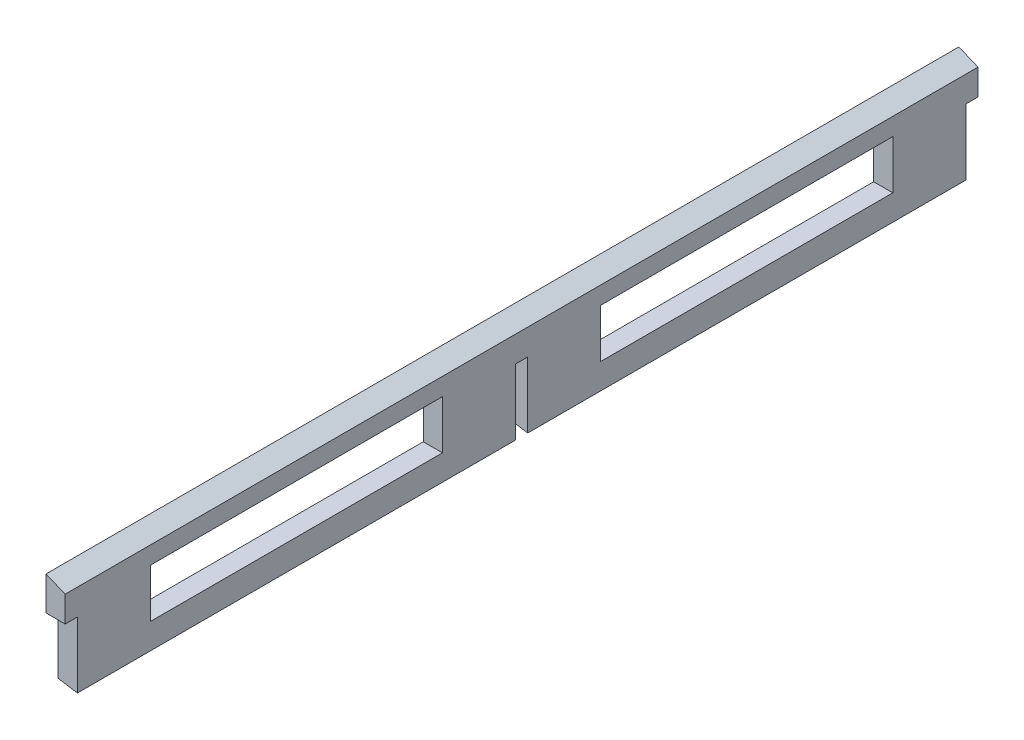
ISO-10303-21;
HEADER;
FILE_DESCRIPTION(('STEP AP214'),'2;1');
FILE_NAME('part.step','',(''),(''),'','','');
FILE_SCHEMA(('AUTOMOTIVE_DESIGN { 1 0 10303 214 1 1 1 1 }'));
ENDSEC;
DATA;
#1=APPLICATION_CONTEXT('core data for automotive mechanical design processes');
#2=APPLICATION_PROTOCOL_DEFINITION('international standard','automotive_design',2000,#1);
#3=PRODUCT_CONTEXT('',#1,'mechanical');
#4=PRODUCT('Part','Part','',(#3));
#5=PRODUCT_RELATED_PRODUCT_CATEGORY('part','',(#4));
#6=PRODUCT_DEFINITION_FORMATION('','',#4);
#7=PRODUCT_DEFINITION_CONTEXT('part definition',#1,'design');
#8=PRODUCT_DEFINITION('design','',#6,#7);
#9=PRODUCT_DEFINITION_SHAPE('','',#8);
#10=(LENGTH_UNIT() NAMED_UNIT(*) SI_UNIT(.MILLI.,.METRE.));
#11=(NAMED_UNIT(*) PLANE_ANGLE_UNIT() SI_UNIT($,.RADIAN.));
#12=(NAMED_UNIT(*) SI_UNIT($,.STERADIAN.) SOLID_ANGLE_UNIT());
#13=UNCERTAINTY_MEASURE_WITH_UNIT(LENGTH_MEASURE(1.E-05),#10,'distance_accuracy_value','');
#14=(GEOMETRIC_REPRESENTATION_CONTEXT(3) GLOBAL_UNCERTAINTY_ASSIGNED_CONTEXT((#13)) GLOBAL_UNIT_ASSIGNED_CONTEXT((#10,
#11,#12)) REPRESENTATION_CONTEXT('',''));
#15=CARTESIAN_POINT('',(0.,0.,0.));
#16=DIRECTION('',(0.,0.,1.));
#17=DIRECTION('',(1.,0.,0.));
#18=AXIS2_PLACEMENT_3D('',#15,#16,#17);
#19=CARTESIAN_POINT('',(446.666248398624,0.,300.12));
#20=DIRECTION('',(-1.,0.,0.));
#21=DIRECTION('',(0.,0.,1.));
#22=AXIS2_PLACEMENT_3D('',#19,#20,#21);
#23=PLANE('',#22);
#24=DIRECTION('',(0.,0.,1.));
#25=VECTOR('',#24,1.);
#26=CARTESIAN_POINT('',(446.666248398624,-53.9431435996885,300.12));
#27=LINE('',#26,#25);
#28=CARTESIAN_POINT('',(446.666248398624,-53.9431435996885,139.7));
#29=VERTEX_POINT('',#28);
#30=CARTESIAN_POINT('',(446.666248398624,-53.9431435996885,215.9));
#31=VERTEX_POINT('',#30);
#32=EDGE_CURVE('E302',#29,#31,#27,.T.);
#33=ORIENTED_EDGE('',*,*,#32,.F.);
#34=DIRECTION('',(0.,-1.,0.));
#35=VECTOR('',#34,1.);
#36=CARTESIAN_POINT('',(446.666248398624,0.,139.7));
#37=LINE('',#36,#35);
#38=CARTESIAN_POINT('',(446.666248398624,-41.2431435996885,139.7));
#39=VERTEX_POINT('',#38);
#40=EDGE_CURVE('E293',#39,#29,#37,.T.);
#41=ORIENTED_EDGE('',*,*,#40,.F.);
#42=DIRECTION('',(0.,0.,1.));
#43=VECTOR('',#42,1.);
#44=CARTESIAN_POINT('',(446.666248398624,-41.2431435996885,300.12));
#45=LINE('',#44,#43);
#46=CARTESIAN_POINT('',(446.666248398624,-41.2431435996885,215.9));
#47=VERTEX_POINT('',#46);
#48=EDGE_CURVE('E218',#39,#47,#45,.T.);
#49=ORIENTED_EDGE('',*,*,#48,.T.);
#50=DIRECTION('',(0.,-1.,0.));
#51=VECTOR('',#50,1.);
#52=CARTESIAN_POINT('',(446.666248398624,0.,215.9));
#53=LINE('',#52,#51);
#54=EDGE_CURVE('E298',#47,#31,#53,.T.);
#55=ORIENTED_EDGE('',*,*,#54,.T.);
#56=EDGE_LOOP('',(#33,#41,#49,#55));
#57=FACE_BOUND('',#56,.T.);
#58=DIRECTION('',(0.,-1.,0.));
#59=VECTOR('',#58,1.);
#60=CARTESIAN_POINT('',(446.666248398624,0.,238.125));
#61=LINE('',#60,#59);
#62=CARTESIAN_POINT('',(446.666248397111,-34.5946452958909,238.125));
#63=VERTEX_POINT('',#62);
#64=CARTESIAN_POINT('',(446.666248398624,-43.4066019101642,238.125));
#65=VERTEX_POINT('',#64);
#66=EDGE_CURVE('E309',#63,#65,#61,.T.);
#67=ORIENTED_EDGE('',*,*,#66,.F.);
#68=DIRECTION('',(0.,0.,1.));
#69=VECTOR('',#68,1.);
#70=CARTESIAN_POINT('',(446.666248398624,-34.5946452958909,-22.9307442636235));
#71=LINE('',#70,#69);
#72=CARTESIAN_POINT('',(446.666248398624,-34.5946452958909,0.));
#73=VERTEX_POINT('',#72);
#74=EDGE_CURVE('E419',#73,#63,#71,.T.);
#75=ORIENTED_EDGE('',*,*,#74,.F.);
#76=DIRECTION('',(0.,1.,0.));
#77=VECTOR('',#76,1.);
#78=CARTESIAN_POINT('',(446.666248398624,7.78722275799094,0.));
#79=LINE('',#78,#77);
#80=CARTESIAN_POINT('',(446.666248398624,-43.4066019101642,0.));
#81=VERTEX_POINT('',#80);
#82=EDGE_CURVE('E415',#81,#73,#79,.T.);
#83=ORIENTED_EDGE('',*,*,#82,.F.);
#84=DIRECTION('',(0.,0.,-1.));
#85=VECTOR('',#84,1.);
#86=CARTESIAN_POINT('',(446.666248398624,-43.4066019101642,3.175));
#87=LINE('',#86,#85);
#88=CARTESIAN_POINT('',(446.666248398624,-43.4066019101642,3.175));
#89=VERTEX_POINT('',#88);
#90=EDGE_CURVE('E420',#89,#81,#87,.T.);
#91=ORIENTED_EDGE('',*,*,#90,.F.);
#92=DIRECTION('',(0.,1.,0.));
#93=VECTOR('',#92,1.);
#94=CARTESIAN_POINT('',(446.666248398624,25.3981079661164,3.175));
#95=LINE('',#94,#93);
#96=CARTESIAN_POINT('',(446.666248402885,-59.7523182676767,3.17500000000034));
#97=VERTEX_POINT('',#96);
#98=EDGE_CURVE('E585',#97,#89,#95,.T.);
#99=ORIENTED_EDGE('',*,*,#98,.F.);
#100=DIRECTION('',(0.,0.,1.));
#101=VECTOR('',#100,1.);
#102=CARTESIAN_POINT('',(446.666248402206,-59.752345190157,-0.0499999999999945));
#103=LINE('',#102,#101);
#104=CARTESIAN_POINT('',(446.666248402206,-59.752345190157,4.81200000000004));
#105=VERTEX_POINT('',#104);
#106=EDGE_CURVE('E404',#97,#105,#103,.T.);
#107=ORIENTED_EDGE('',*,*,#106,.T.);
#108=DIRECTION('',(0.,0.,1.));
#109=VECTOR('',#108,1.);
#110=CARTESIAN_POINT('',(446.666248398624,-59.752345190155,142.974));
#111=LINE('',#110,#109);
#112=CARTESIAN_POINT('',(446.666248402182,-59.752345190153,117.475));
#113=VERTEX_POINT('',#112);
#114=EDGE_CURVE('E599',#105,#113,#111,.T.);
#115=ORIENTED_EDGE('',*,*,#114,.T.);
#116=DIRECTION('',(-2.17663776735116E-10,1.,0.));
#117=VECTOR('',#116,1.);
#118=CARTESIAN_POINT('',(446.666248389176,9.72230625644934E-08,117.475));
#119=LINE('',#118,#117);
#120=CARTESIAN_POINT('',(446.666248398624,-43.4066019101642,117.475));
#121=VERTEX_POINT('',#120);
#122=EDGE_CURVE('E319',#113,#121,#119,.T.);
#123=ORIENTED_EDGE('',*,*,#122,.T.);
#124=DIRECTION('',(0.,0.,1.));
#125=VECTOR('',#124,1.);
#126=CARTESIAN_POINT('',(446.666248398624,-43.4066019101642,117.475));
#127=LINE('',#126,#125);
#128=CARTESIAN_POINT('',(446.666248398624,-43.4066019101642,120.65));
#129=VERTEX_POINT('',#128);
#130=EDGE_CURVE('E362',#121,#129,#127,.T.);
#131=ORIENTED_EDGE('',*,*,#130,.T.);
#132=DIRECTION('',(-2.17663776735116E-10,1.,0.));
#133=VECTOR('',#132,1.);
#134=CARTESIAN_POINT('',(446.666248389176,9.72230625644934E-08,120.65));
#135=LINE('',#134,#133);
#136=CARTESIAN_POINT('',(446.666248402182,-59.752345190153,120.65));
#137=VERTEX_POINT('',#136);
#138=EDGE_CURVE('E318',#137,#129,#135,.T.);
#139=ORIENTED_EDGE('',*,*,#138,.F.);
#140=CARTESIAN_POINT('',(446.666248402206,-59.752345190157,156.958));
#141=VERTEX_POINT('',#140);
#142=EDGE_CURVE('E597',#137,#141,#111,.T.);
#143=ORIENTED_EDGE('',*,*,#142,.T.);
#144=CARTESIAN_POINT('',(446.666248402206,-59.752345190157,161.958));
#145=VERTEX_POINT('',#144);
#146=EDGE_CURVE('E391',#141,#145,#103,.T.);
#147=ORIENTED_EDGE('',*,*,#146,.T.);
#148=CARTESIAN_POINT('',(446.666248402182,-59.752345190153,234.95));
#149=VERTEX_POINT('',#148);
#150=EDGE_CURVE('E440',#145,#149,#111,.T.);
#151=ORIENTED_EDGE('',*,*,#150,.T.);
#152=DIRECTION('',(2.17663776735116E-10,-1.,0.));
#153=VECTOR('',#152,1.);
#154=CARTESIAN_POINT('',(446.666248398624,-43.4066019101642,234.95));
#155=LINE('',#154,#153);
#156=CARTESIAN_POINT('',(446.666248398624,-43.4066019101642,234.95));
#157=VERTEX_POINT('',#156);
#158=EDGE_CURVE('E384',#157,#149,#155,.T.);
#159=ORIENTED_EDGE('',*,*,#158,.F.);
#160=DIRECTION('',(0.,0.,1.));
#161=VECTOR('',#160,1.);
#162=CARTESIAN_POINT('',(446.666248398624,-43.4066019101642,234.95));
#163=LINE('',#162,#161);
#164=EDGE_CURVE('E369',#157,#65,#163,.T.);
#165=ORIENTED_EDGE('',*,*,#164,.T.);
#166=EDGE_LOOP('',(#67,#75,#83,#91,#99,#107,#115,#123,#131,#139,#143,#147,#151,#159,#165));
#167=FACE_BOUND('',#166,.T.);
#168=DIRECTION('',(0.,-1.,0.));
#169=VECTOR('',#168,1.);
#170=CARTESIAN_POINT('',(446.666248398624,0.,98.4250000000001));
#171=LINE('',#170,#169);
#172=CARTESIAN_POINT('',(446.666248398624,-41.2431435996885,98.4250000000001));
#173=VERTEX_POINT('',#172);
#174=CARTESIAN_POINT('',(446.666248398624,-53.9431435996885,98.4250000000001));
#175=VERTEX_POINT('',#174);
#176=EDGE_CURVE('E285',#173,#175,#171,.T.);
#177=ORIENTED_EDGE('',*,*,#176,.T.);
#178=DIRECTION('',(0.,0.,-1.));
#179=VECTOR('',#178,1.);
#180=CARTESIAN_POINT('',(446.666248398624,-53.9431435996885,300.12));
#181=LINE('',#180,#179);
#182=CARTESIAN_POINT('',(446.666248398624,-53.9431435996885,22.2250000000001));
#183=VERTEX_POINT('',#182);
#184=EDGE_CURVE('E289',#175,#183,#181,.T.);
#185=ORIENTED_EDGE('',*,*,#184,.T.);
#186=DIRECTION('',(0.,-1.,0.));
#187=VECTOR('',#186,1.);
#188=CARTESIAN_POINT('',(446.666248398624,0.,22.2250000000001));
#189=LINE('',#188,#187);
#190=CARTESIAN_POINT('',(446.666248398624,-41.2431435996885,22.2250000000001));
#191=VERTEX_POINT('',#190);
#192=EDGE_CURVE('E248',#191,#183,#189,.T.);
#193=ORIENTED_EDGE('',*,*,#192,.F.);
#194=DIRECTION('',(0.,0.,-1.));
#195=VECTOR('',#194,1.);
#196=CARTESIAN_POINT('',(446.666248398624,-41.2431435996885,300.12));
#197=LINE('',#196,#195);
#198=EDGE_CURVE('E282',#173,#191,#197,.T.);
#199=ORIENTED_EDGE('',*,*,#198,.F.);
#200=EDGE_LOOP('',(#177,#185,#193,#199));
#201=FACE_BOUND('',#200,.T.);
#202=ADVANCED_FACE('F55',(#57,#167,#201),#23,.T.);
#203=CARTESIAN_POINT('',(451.666248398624,0.,300.12));
#204=DIRECTION('',(-1.,0.,0.));
#205=DIRECTION('',(0.,0.,1.));
#206=AXIS2_PLACEMENT_3D('',#203,#204,#205);
#207=PLANE('',#206);
#208=DIRECTION('',(0.,1.,0.));
#209=VECTOR('',#208,1.);
#210=CARTESIAN_POINT('',(451.666248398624,0.,139.7));
#211=LINE('',#210,#209);
#212=CARTESIAN_POINT('',(451.666248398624,-53.9431435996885,139.7));
#213=VERTEX_POINT('',#212);
#214=CARTESIAN_POINT('',(451.666248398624,-41.2431435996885,139.7));
#215=VERTEX_POINT('',#214);
#216=EDGE_CURVE('E226',#213,#215,#211,.T.);
#217=ORIENTED_EDGE('',*,*,#216,.F.);
#218=DIRECTION('',(0.,0.,-1.));
#219=VECTOR('',#218,1.);
#220=CARTESIAN_POINT('',(451.666248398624,-53.9431435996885,0.));
#221=LINE('',#220,#219);
#222=CARTESIAN_POINT('',(451.666248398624,-53.9431435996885,215.9));
#223=VERTEX_POINT('',#222);
#224=EDGE_CURVE('E232',#223,#213,#221,.T.);
#225=ORIENTED_EDGE('',*,*,#224,.F.);
#226=DIRECTION('',(0.,1.,0.));
#227=VECTOR('',#226,1.);
#228=CARTESIAN_POINT('',(451.666248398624,0.,215.9));
#229=LINE('',#228,#227);
#230=CARTESIAN_POINT('',(451.666248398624,-41.2431435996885,215.9));
#231=VERTEX_POINT('',#230);
#232=EDGE_CURVE('E237',#223,#231,#229,.T.);
#233=ORIENTED_EDGE('',*,*,#232,.T.);
#234=DIRECTION('',(0.,0.,-1.));
#235=VECTOR('',#234,1.);
#236=CARTESIAN_POINT('',(451.666248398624,-41.2431435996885,0.));
#237=LINE('',#236,#235);
#238=EDGE_CURVE('E215',#231,#215,#237,.T.);
#239=ORIENTED_EDGE('',*,*,#238,.T.);
#240=EDGE_LOOP('',(#217,#225,#233,#239));
#241=FACE_BOUND('',#240,.T.);
#242=DIRECTION('',(0.,0.,1.));
#243=VECTOR('',#242,1.);
#244=CARTESIAN_POINT('',(451.666248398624,-36.6546452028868,-22.9307442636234));
#245=LINE('',#244,#243);
#246=CARTESIAN_POINT('',(451.666248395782,-36.6546452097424,0.));
#247=VERTEX_POINT('',#246);
#248=CARTESIAN_POINT('',(451.666248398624,-36.6546452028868,238.125));
#249=VERTEX_POINT('',#248);
#250=EDGE_CURVE('E430',#247,#249,#245,.T.);
#251=ORIENTED_EDGE('',*,*,#250,.T.);
#252=DIRECTION('',(0.,-1.,0.));
#253=VECTOR('',#252,1.);
#254=CARTESIAN_POINT('',(451.666248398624,0.,238.125));
#255=LINE('',#254,#253);
#256=CARTESIAN_POINT('',(451.666248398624,-43.4066019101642,238.125));
#257=VERTEX_POINT('',#256);
#258=EDGE_CURVE('E305',#249,#257,#255,.T.);
#259=ORIENTED_EDGE('',*,*,#258,.T.);
#260=DIRECTION('',(0.,0.,1.));
#261=VECTOR('',#260,1.);
#262=CARTESIAN_POINT('',(451.666248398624,-43.4066019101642,234.95));
#263=LINE('',#262,#261);
#264=CARTESIAN_POINT('',(451.666248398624,-43.4066019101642,234.95));
#265=VERTEX_POINT('',#264);
#266=EDGE_CURVE('E366',#265,#257,#263,.T.);
#267=ORIENTED_EDGE('',*,*,#266,.F.);
#268=DIRECTION('',(0.,1.,0.));
#269=VECTOR('',#268,1.);
#270=CARTESIAN_POINT('',(451.666248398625,-60.5916419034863,234.95));
#271=LINE('',#270,#269);
#272=CARTESIAN_POINT('',(451.666248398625,-60.591641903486,234.95));
#273=VERTEX_POINT('',#272);
#274=EDGE_CURVE('E373',#273,#265,#271,.T.);
#275=ORIENTED_EDGE('',*,*,#274,.F.);
#276=DIRECTION('',(0.,0.,1.));
#277=VECTOR('',#276,1.);
#278=CARTESIAN_POINT('',(451.666248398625,-60.5916419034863,142.974));
#279=LINE('',#278,#277);
#280=CARTESIAN_POINT('',(451.666248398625,-60.5916419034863,161.958));
#281=VERTEX_POINT('',#280);
#282=EDGE_CURVE('E483',#281,#273,#279,.T.);
#283=ORIENTED_EDGE('',*,*,#282,.F.);
#284=DIRECTION('',(0.,0.,1.));
#285=VECTOR('',#284,1.);
#286=CARTESIAN_POINT('',(451.666248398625,-60.5916419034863,-0.0499999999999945));
#287=LINE('',#286,#285);
#288=CARTESIAN_POINT('',(451.666248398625,-60.5916419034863,156.958));
#289=VERTEX_POINT('',#288);
#290=EDGE_CURVE('E401',#289,#281,#287,.T.);
#291=ORIENTED_EDGE('',*,*,#290,.F.);
#292=CARTESIAN_POINT('',(451.666248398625,-60.5916419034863,120.65));
#293=VERTEX_POINT('',#292);
#294=EDGE_CURVE('E595',#293,#289,#279,.T.);
#295=ORIENTED_EDGE('',*,*,#294,.F.);
#296=DIRECTION('',(0.,1.,0.));
#297=VECTOR('',#296,1.);
#298=CARTESIAN_POINT('',(451.666248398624,4.37691970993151E-12,120.65));
#299=LINE('',#298,#297);
#300=CARTESIAN_POINT('',(451.666248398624,-43.4066019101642,120.65));
#301=VERTEX_POINT('',#300);
#302=EDGE_CURVE('E352',#293,#301,#299,.T.);
#303=ORIENTED_EDGE('',*,*,#302,.T.);
#304=DIRECTION('',(0.,0.,1.));
#305=VECTOR('',#304,1.);
#306=CARTESIAN_POINT('',(451.666248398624,-43.4066019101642,117.475));
#307=LINE('',#306,#305);
#308=CARTESIAN_POINT('',(451.666248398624,-43.4066019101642,117.475));
#309=VERTEX_POINT('',#308);
#310=EDGE_CURVE('E342',#309,#301,#307,.T.);
#311=ORIENTED_EDGE('',*,*,#310,.F.);
#312=DIRECTION('',(0.,1.,0.));
#313=VECTOR('',#312,1.);
#314=CARTESIAN_POINT('',(451.666248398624,4.37691970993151E-12,117.475));
#315=LINE('',#314,#313);
#316=CARTESIAN_POINT('',(451.666248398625,-60.5916419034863,117.475));
#317=VERTEX_POINT('',#316);
#318=EDGE_CURVE('E332',#317,#309,#315,.T.);
#319=ORIENTED_EDGE('',*,*,#318,.F.);
#320=CARTESIAN_POINT('',(451.666248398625,-60.5916419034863,4.81200000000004));
#321=VERTEX_POINT('',#320);
#322=EDGE_CURVE('E482',#321,#317,#279,.T.);
#323=ORIENTED_EDGE('',*,*,#322,.F.);
#324=CARTESIAN_POINT('',(451.666248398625,-60.5916419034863,3.175));
#325=VERTEX_POINT('',#324);
#326=EDGE_CURVE('E398',#325,#321,#287,.T.);
#327=ORIENTED_EDGE('',*,*,#326,.F.);
#328=DIRECTION('',(0.,1.,0.));
#329=VECTOR('',#328,1.);
#330=CARTESIAN_POINT('',(451.666248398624,25.3981079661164,3.175));
#331=LINE('',#330,#329);
#332=CARTESIAN_POINT('',(451.666248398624,-43.4066019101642,3.175));
#333=VERTEX_POINT('',#332);
#334=EDGE_CURVE('E66',#325,#333,#331,.T.);
#335=ORIENTED_EDGE('',*,*,#334,.T.);
#336=DIRECTION('',(0.,0.,-1.));
#337=VECTOR('',#336,1.);
#338=CARTESIAN_POINT('',(451.666248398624,-43.4066019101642,3.175));
#339=LINE('',#338,#337);
#340=CARTESIAN_POINT('',(451.666248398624,-43.4066019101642,0.));
#341=VERTEX_POINT('',#340);
#342=EDGE_CURVE('E416',#333,#341,#339,.T.);
#343=ORIENTED_EDGE('',*,*,#342,.T.);
#344=DIRECTION('',(0.,1.,0.));
#345=VECTOR('',#344,1.);
#346=CARTESIAN_POINT('',(451.666248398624,7.78722275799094,0.));
#347=LINE('',#346,#345);
#348=EDGE_CURVE('E410',#341,#247,#347,.T.);
#349=ORIENTED_EDGE('',*,*,#348,.T.);
#350=EDGE_LOOP('',(#251,#259,#267,#275,#283,#291,#295,#303,#311,#319,#323,#327,#335,#343,#349));
#351=FACE_BOUND('',#350,.T.);
#352=DIRECTION('',(0.,0.,1.));
#353=VECTOR('',#352,1.);
#354=CARTESIAN_POINT('',(451.666248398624,-53.9431435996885,0.));
#355=LINE('',#354,#353);
#356=CARTESIAN_POINT('',(451.666248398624,-53.9431435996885,22.2250000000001));
#357=VERTEX_POINT('',#356);
#358=CARTESIAN_POINT('',(451.666248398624,-53.9431435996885,98.4250000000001));
#359=VERTEX_POINT('',#358);
#360=EDGE_CURVE('E253',#357,#359,#355,.T.);
#361=ORIENTED_EDGE('',*,*,#360,.T.);
#362=DIRECTION('',(0.,1.,0.));
#363=VECTOR('',#362,1.);
#364=CARTESIAN_POINT('',(451.666248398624,0.,98.4250000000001));
#365=LINE('',#364,#363);
#366=CARTESIAN_POINT('',(451.666248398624,-41.2431435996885,98.4250000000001));
#367=VERTEX_POINT('',#366);
#368=EDGE_CURVE('E264',#359,#367,#365,.T.);
#369=ORIENTED_EDGE('',*,*,#368,.T.);
#370=DIRECTION('',(0.,0.,1.));
#371=VECTOR('',#370,1.);
#372=CARTESIAN_POINT('',(451.666248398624,-41.2431435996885,0.));
#373=LINE('',#372,#371);
#374=CARTESIAN_POINT('',(451.666248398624,-41.2431435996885,22.2250000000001));
#375=VERTEX_POINT('',#374);
#376=EDGE_CURVE('E260',#375,#367,#373,.T.);
#377=ORIENTED_EDGE('',*,*,#376,.F.);
#378=DIRECTION('',(0.,1.,0.));
#379=VECTOR('',#378,1.);
#380=CARTESIAN_POINT('',(451.666248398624,0.,22.2250000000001));
#381=LINE('',#380,#379);
#382=EDGE_CURVE('E257',#357,#375,#381,.T.);
#383=ORIENTED_EDGE('',*,*,#382,.F.);
#384=EDGE_LOOP('',(#361,#369,#377,#383));
#385=FACE_BOUND('',#384,.T.);
#386=ADVANCED_FACE('F234',(#241,#351,#385),#207,.F.);
#387=CARTESIAN_POINT('',(446.666248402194,-59.752345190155,142.974));
#388=CARTESIAN_POINT('',(448.33315738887,-60.0306560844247,142.974));
#389=CARTESIAN_POINT('',(449.999821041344,-60.3103818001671,142.974));
#390=CARTESIAN_POINT('',(451.666248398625,-60.5916419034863,142.974));
#391=B_SPLINE_CURVE_WITH_KNOTS('',3,(#387,#388,#389,#390),.UNSPECIFIED.,.F.,.F.,(4,4),(0.,1.),.UNSPECIFIED.);
#392=DIRECTION('',(0.,0.,1.));
#393=VECTOR('',#392,1.);
#394=SURFACE_OF_LINEAR_EXTRUSION('',#391,#393);
#395=ORIENTED_EDGE('',*,*,#322,.T.);
#396=CARTESIAN_POINT('',(446.66624840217,-59.752345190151,117.475));
#397=CARTESIAN_POINT('',(448.333157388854,-60.030656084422,117.475));
#398=CARTESIAN_POINT('',(449.999821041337,-60.3103818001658,117.475));
#399=CARTESIAN_POINT('',(451.666248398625,-60.5916419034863,117.475));
#400=B_SPLINE_CURVE_WITH_KNOTS('',3,(#396,#397,#398,#399),.UNSPECIFIED.,.F.,.F.,(4,4),
(0.920047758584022,0.92462123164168),.UNSPECIFIED.);
#401=EDGE_CURVE('E326',#113,#317,#400,.T.);
#402=ORIENTED_EDGE('',*,*,#401,.F.);
#403=ORIENTED_EDGE('',*,*,#114,.F.);
#404=CARTESIAN_POINT('',(446.666248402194,-59.752345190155,4.81200000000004));
#405=CARTESIAN_POINT('',(448.33315738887,-60.0306560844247,4.81200000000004));
#406=CARTESIAN_POINT('',(449.999821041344,-60.3103818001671,4.81200000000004));
#407=CARTESIAN_POINT('',(451.666248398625,-60.5916419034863,4.81200000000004));
#408=B_SPLINE_CURVE_WITH_KNOTS('',3,(#404,#405,#406,#407),.UNSPECIFIED.,.F.,.F.,(4,4),(0.,1.),.UNSPECIFIED.);
#409=EDGE_CURVE('E434',#321,#105,#408,.F.);
#410=ORIENTED_EDGE('',*,*,#409,.F.);
#411=EDGE_LOOP('',(#395,#402,#403,#410));
#412=FACE_BOUND('',#411,.T.);
#413=ADVANCED_FACE('F454',(#412),#394,.T.);
#414=ORIENTED_EDGE('',*,*,#282,.T.);
#415=CARTESIAN_POINT('',(-25.4924587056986,-2887.8889333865,234.95));
#416=DIRECTION('',(0.,0.,1.));
#417=DIRECTION('',(1.,0.,0.));
#418=AXIS2_PLACEMENT_3D('',#415,#416,#417);
#419=CIRCLE('',#418,2867.27926895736);
#420=EDGE_CURVE('E380',#273,#149,#419,.T.);
#421=ORIENTED_EDGE('',*,*,#420,.T.);
#422=ORIENTED_EDGE('',*,*,#150,.F.);
#423=CARTESIAN_POINT('',(451.666248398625,-60.5916419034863,161.958));
#424=CARTESIAN_POINT('',(451.249641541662,-60.5213268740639,161.958));
#425=CARTESIAN_POINT('',(450.833018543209,-60.4511075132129,161.958));
#426=CARTESIAN_POINT('',(449.99974094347,-60.3108565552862,161.958));
#427=CARTESIAN_POINT('',(449.583086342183,-60.2408249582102,161.958));
#428=CARTESIAN_POINT('',(448.333087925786,-60.0310084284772,161.958));
#429=CARTESIAN_POINT('',(447.499697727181,-59.8914997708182,161.958));
#430=CARTESIAN_POINT('',(446.666248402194,-59.752345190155,161.958));
#431=B_SPLINE_CURVE_WITH_KNOTS('',3,(#423,#424,#425,#426,#427,#428,#429,#430),.UNSPECIFIED.,.F.,
.F.,(4,2,2,4),(0.,1.26749723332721,2.5349944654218,5.06995311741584),.UNSPECIFIED.);
#432=EDGE_CURVE('E467',#281,#145,#431,.T.);
#433=ORIENTED_EDGE('',*,*,#432,.F.);
#434=EDGE_LOOP('',(#414,#421,#422,#433));
#435=FACE_BOUND('',#434,.T.);
#436=ADVANCED_FACE('F459',(#435),#394,.T.);
#437=CARTESIAN_POINT('',(446.66624840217,-59.752345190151,120.65));
#438=CARTESIAN_POINT('',(448.333157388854,-60.030656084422,120.65));
#439=CARTESIAN_POINT('',(449.999821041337,-60.3103818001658,120.65));
#440=CARTESIAN_POINT('',(451.666248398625,-60.5916419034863,120.65));
#441=B_SPLINE_CURVE_WITH_KNOTS('',3,(#437,#438,#439,#440),.UNSPECIFIED.,.F.,.F.,(4,4),
(0.920047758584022,0.92462123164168),.UNSPECIFIED.);
#442=EDGE_CURVE('E346',#137,#293,#441,.T.);
#443=ORIENTED_EDGE('',*,*,#442,.T.);
#444=ORIENTED_EDGE('',*,*,#294,.T.);
#445=CARTESIAN_POINT('',(451.666248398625,-60.5916419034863,156.958));
#446=CARTESIAN_POINT('',(451.249641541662,-60.5213268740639,156.958));
#447=CARTESIAN_POINT('',(450.833018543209,-60.4511075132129,156.958));
#448=CARTESIAN_POINT('',(449.99974094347,-60.3108565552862,156.958));
#449=CARTESIAN_POINT('',(449.583086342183,-60.2408249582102,156.958));
#450=CARTESIAN_POINT('',(448.333087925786,-60.0310084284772,156.958));
#451=CARTESIAN_POINT('',(447.499697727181,-59.8914997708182,156.958));
#452=CARTESIAN_POINT('',(446.666248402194,-59.752345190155,156.958));
#453=B_SPLINE_CURVE_WITH_KNOTS('',3,(#445,#446,#447,#448,#449,#450,#451,#452),.UNSPECIFIED.,.F.,
.F.,(4,2,2,4),(0.,1.26749723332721,2.5349944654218,5.06995311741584),.UNSPECIFIED.);
#454=EDGE_CURVE('E474',#289,#141,#453,.T.);
#455=ORIENTED_EDGE('',*,*,#454,.T.);
#456=ORIENTED_EDGE('',*,*,#142,.F.);
#457=EDGE_LOOP('',(#443,#444,#455,#456));
#458=FACE_BOUND('',#457,.T.);
#459=ADVANCED_FACE('F461',(#458),#394,.T.);
#460=CARTESIAN_POINT('',(533.4,-74.964481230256,476.25));
#461=CARTESIAN_POINT('',(533.393468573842,-74.3592932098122,476.25));
#462=CARTESIAN_POINT('',(531.326375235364,-72.9726299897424,476.25));
#463=CARTESIAN_POINT('',(527.400147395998,-71.2980390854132,476.25));
#464=CARTESIAN_POINT('',(520.602221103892,-67.7648945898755,476.25));
#465=CARTESIAN_POINT('',(511.347792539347,-63.3267299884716,476.25));
#466=CARTESIAN_POINT('',(499.502755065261,-57.6778186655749,476.25));
#467=CARTESIAN_POINT('',(485.246764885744,-51.1384096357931,476.25));
#468=CARTESIAN_POINT('',(468.676978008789,-43.8036364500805,476.25));
#469=CARTESIAN_POINT('',(449.947936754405,-35.8757202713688,476.25));
#470=CARTESIAN_POINT('',(429.230598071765,-27.5332286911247,476.25));
#471=CARTESIAN_POINT('',(406.718257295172,-18.9792879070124,476.25));
#472=CARTESIAN_POINT('',(382.640885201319,-10.382344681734,476.25));
#473=CARTESIAN_POINT('',(357.234331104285,-1.94698223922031,476.25));
#474=CARTESIAN_POINT('',(330.760171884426,6.14483374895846,476.25));
#475=CARTESIAN_POINT('',(303.50010629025,13.7381782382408,476.25));
#476=CARTESIAN_POINT('',(275.749595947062,20.6681404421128,476.25));
#477=CARTESIAN_POINT('',(247.797497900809,26.795319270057,476.25));
#478=CARTESIAN_POINT('',(219.77579834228,32.1343026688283,476.25));
#479=CARTESIAN_POINT('',(191.912986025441,36.1053653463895,476.25));
#480=CARTESIAN_POINT('',(164.569256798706,38.4384325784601,476.25));
#481=CARTESIAN_POINT('',(138.326668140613,39.1929872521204,476.25));
#482=CARTESIAN_POINT('',(113.549606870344,38.4856846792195,476.25));
#483=CARTESIAN_POINT('',(90.5807469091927,36.4479003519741,476.25));
#484=CARTESIAN_POINT('',(69.7330173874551,33.2891377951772,476.25));
#485=CARTESIAN_POINT('',(51.2766476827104,29.241370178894,476.25));
#486=CARTESIAN_POINT('',(35.4362610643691,24.539415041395,476.25));
#487=CARTESIAN_POINT('',(22.3884874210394,19.4234784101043,476.25));
#488=CARTESIAN_POINT('',(12.2196962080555,14.1253370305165,476.25));
#489=CARTESIAN_POINT('',(4.99901469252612,8.78084818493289,476.25));
#490=CARTESIAN_POINT('',(0.528637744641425,3.39704674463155,476.25));
#491=CARTESIAN_POINT('',(-0.609774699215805,-2.47889500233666,476.25));
#492=CARTESIAN_POINT('',(2.2546949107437,-7.70032156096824,476.25));
#493=CARTESIAN_POINT('',(8.00374597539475,-11.5081485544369,476.25));
#494=CARTESIAN_POINT('',(16.1982900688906,-14.6095937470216,476.25));
#495=CARTESIAN_POINT('',(26.9584985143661,-17.1149449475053,476.25));
#496=CARTESIAN_POINT('',(40.1607249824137,-19.119889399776,476.25));
#497=CARTESIAN_POINT('',(55.6666229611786,-20.6931815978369,476.25));
#498=CARTESIAN_POINT('',(73.2848054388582,-21.9411220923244,476.25));
#499=CARTESIAN_POINT('',(92.8177540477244,-22.9728124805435,476.25));
#500=CARTESIAN_POINT('',(114.052803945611,-23.9452202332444,476.25));
#501=CARTESIAN_POINT('',(136.779007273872,-24.9935512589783,476.25));
#502=CARTESIAN_POINT('',(160.778166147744,-26.2653553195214,476.25));
#503=CARTESIAN_POINT('',(185.828467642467,-27.915792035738,476.25));
#504=CARTESIAN_POINT('',(211.89529547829,-30.1378921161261,476.25));
#505=CARTESIAN_POINT('',(238.754061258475,-32.8568494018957,476.25));
#506=CARTESIAN_POINT('',(266.18062536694,-35.6241165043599,476.25));
#507=CARTESIAN_POINT('',(293.670265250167,-38.5940579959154,476.25));
#508=CARTESIAN_POINT('',(320.914949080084,-41.7432849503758,476.25));
#509=CARTESIAN_POINT('',(347.620557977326,-45.0642539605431,476.25));
#510=CARTESIAN_POINT('',(373.491842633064,-48.5288730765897,476.25));
#511=CARTESIAN_POINT('',(398.242667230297,-52.0819020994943,476.25));
#512=CARTESIAN_POINT('',(421.599418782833,-55.6440146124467,476.25));
#513=CARTESIAN_POINT('',(443.29349060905,-59.1670522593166,476.25));
#514=CARTESIAN_POINT('',(463.083690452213,-62.5183563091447,476.25));
#515=CARTESIAN_POINT('',(480.742383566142,-65.6572438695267,476.25));
#516=CARTESIAN_POINT('',(496.042405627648,-68.4378938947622,476.25));
#517=CARTESIAN_POINT('',(508.873832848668,-70.9319094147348,476.25));
#518=CARTESIAN_POINT('',(518.888745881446,-72.641498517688,476.25));
#519=CARTESIAN_POINT('',(526.44030087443,-74.6129246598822,476.25));
#520=CARTESIAN_POINT('',(530.448180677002,-74.5383148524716,476.25));
#521=CARTESIAN_POINT('',(533.132177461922,-76.0695207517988,476.25));
#522=CARTESIAN_POINT('',(533.402547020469,-75.2004827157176,476.25));
#523=CARTESIAN_POINT('',(533.4,-74.964481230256,476.25));
#524=B_SPLINE_CURVE_WITH_KNOTS('',3,(#460,#461,#462,#463,#464,#465,#466,#467,#468,#469,#470,
#471,#472,#473,#474,#475,#476,#477,#478,#479,#480,#481,#482,#483,#484,#485,#486,#487,#488,#489,
#490,#491,#492,#493,#494,#495,#496,#497,#498,#499,#500,#501,#502,#503,#504,#505,#506,#507,#508,
#509,#510,#511,#512,#513,#514,#515,#516,#517,#518,#519,#520,#521,#522,#523),.UNSPECIFIED.,.T.,
.F.,(4,1,1,1,1,1,1,1,1,1,1,1,1,1,1,1,1,1,1,1,1,1,1,1,1,1,1,1,1,1,1,1,1,1,1,1,1,1,1,1,1,1,1,1,1,
1,1,1,1,1,1,1,1,1,1,1,1,1,1,1,1,4),(0.,0.00157509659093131,0.00566746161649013,
0.0124361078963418,0.0218013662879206,0.0336583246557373,0.0478653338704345,0.0642720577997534,
0.0826832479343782,0.102902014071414,0.124705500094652,0.147849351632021,0.17208133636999,
0.197142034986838,0.222755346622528,0.248649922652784,0.274532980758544,0.300183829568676,
0.325827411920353,0.35065745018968,0.37440722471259,0.396834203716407,0.417695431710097,
0.436768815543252,0.45385571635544,0.46878827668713,0.481435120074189,0.491734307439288,
0.499717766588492,0.505647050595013,0.510284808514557,0.51492307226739,0.520799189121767,
0.528612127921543,0.538559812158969,0.550634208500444,0.564731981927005,0.580723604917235,
0.598426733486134,0.617662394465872,0.638248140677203,0.659991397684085,0.682696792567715,
0.70618055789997,0.730782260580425,0.755750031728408,0.780776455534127,0.805604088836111,
0.829967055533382,0.853600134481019,0.876238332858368,0.897630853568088,0.917536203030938,
0.935711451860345,0.951952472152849,0.966054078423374,0.977844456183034,0.987176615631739,
0.993932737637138,0.998018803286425,0.999385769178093,1.),.UNSPECIFIED.);
#525=DIRECTION('',(0.,0.,-1.));
#526=VECTOR('',#525,1.);
#527=SURFACE_OF_LINEAR_EXTRUSION('',#524,#526);
#528=ORIENTED_EDGE('',*,*,#454,.F.);
#529=ORIENTED_EDGE('',*,*,#290,.T.);
#530=ORIENTED_EDGE('',*,*,#432,.T.);
#531=ORIENTED_EDGE('',*,*,#146,.F.);
#532=EDGE_LOOP('',(#528,#529,#530,#531));
#533=FACE_BOUND('',#532,.T.);
#534=ADVANCED_FACE('F497',(#533),#527,.F.);
#535=CARTESIAN_POINT('',(253.871851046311,25.3981079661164,3.175));
#536=DIRECTION('',(0.,0.,-1.));
#537=DIRECTION('',(-1.,0.,0.));
#538=AXIS2_PLACEMENT_3D('',#535,#536,#537);
#539=PLANE('',#538);
#540=ORIENTED_EDGE('',*,*,#334,.F.);
#541=CARTESIAN_POINT('',(446.666239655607,-59.752343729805,3.17500000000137));
#542=CARTESIAN_POINT('',(448.333151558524,-60.0306551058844,3.17500000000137));
#543=CARTESIAN_POINT('',(449.999818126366,-60.3103813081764,3.17500000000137));
#544=CARTESIAN_POINT('',(451.666248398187,-60.5916419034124,3.17500000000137));
#545=B_SPLINE_CURVE_WITH_KNOTS('',3,(#541,#542,#543,#544),.UNSPECIFIED.,.F.,.F.,(4,4),
(0.92004775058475,0.924621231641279),.UNSPECIFIED.);
#546=EDGE_CURVE('E409',#97,#325,#545,.T.);
#547=ORIENTED_EDGE('',*,*,#546,.F.);
#548=ORIENTED_EDGE('',*,*,#98,.T.);
#549=DIRECTION('',(1.,0.,0.));
#550=VECTOR('',#549,1.);
#551=CARTESIAN_POINT('',(4.42497203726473,-43.4066019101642,3.175));
#552=LINE('',#551,#550);
#553=EDGE_CURVE('E405',#89,#333,#552,.T.);
#554=ORIENTED_EDGE('',*,*,#553,.T.);
#555=EDGE_LOOP('',(#540,#547,#548,#554));
#556=FACE_BOUND('',#555,.T.);
#557=ADVANCED_FACE('F563',(#556),#539,.T.);
#558=ORIENTED_EDGE('',*,*,#546,.T.);
#559=ORIENTED_EDGE('',*,*,#326,.T.);
#560=ORIENTED_EDGE('',*,*,#409,.T.);
#561=ORIENTED_EDGE('',*,*,#106,.F.);
#562=EDGE_LOOP('',(#558,#559,#560,#561));
#563=FACE_BOUND('',#562,.T.);
#564=ADVANCED_FACE('F496',(#563),#527,.F.);
#565=CARTESIAN_POINT('',(4.42497203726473,-43.4066019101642,3.175));
#566=DIRECTION('',(0.,1.,0.));
#567=DIRECTION('',(0.,0.,1.));
#568=AXIS2_PLACEMENT_3D('',#565,#566,#567);
#569=PLANE('',#568);
#570=DIRECTION('',(1.,0.,0.));
#571=VECTOR('',#570,1.);
#572=CARTESIAN_POINT('',(4.42497203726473,-43.4066019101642,0.));
#573=LINE('',#572,#571);
#574=EDGE_CURVE('E411',#81,#341,#573,.T.);
#575=ORIENTED_EDGE('',*,*,#574,.T.);
#576=ORIENTED_EDGE('',*,*,#342,.F.);
#577=ORIENTED_EDGE('',*,*,#553,.F.);
#578=ORIENTED_EDGE('',*,*,#90,.T.);
#579=EDGE_LOOP('',(#575,#576,#577,#578));
#580=FACE_BOUND('',#579,.T.);
#581=ADVANCED_FACE('F462',(#580),#569,.F.);
#582=CARTESIAN_POINT('',(4.42497203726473,7.78722275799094,0.));
#583=DIRECTION('',(0.,0.,-1.));
#584=DIRECTION('',(-1.,0.,0.));
#585=AXIS2_PLACEMENT_3D('',#582,#583,#584);
#586=PLANE('',#585);
#587=ORIENTED_EDGE('',*,*,#348,.F.);
#588=ORIENTED_EDGE('',*,*,#574,.F.);
#589=ORIENTED_EDGE('',*,*,#82,.T.);
#590=CARTESIAN_POINT('',(533.4,-74.964481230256,0.));
#591=CARTESIAN_POINT('',(533.393468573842,-74.3592932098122,0.));
#592=CARTESIAN_POINT('',(531.326375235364,-72.9726299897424,0.));
#593=CARTESIAN_POINT('',(527.400147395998,-71.2980390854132,0.));
#594=CARTESIAN_POINT('',(520.602221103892,-67.7648945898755,0.));
#595=CARTESIAN_POINT('',(511.347792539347,-63.3267299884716,0.));
#596=CARTESIAN_POINT('',(499.502755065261,-57.6778186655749,0.));
#597=CARTESIAN_POINT('',(485.246764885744,-51.1384096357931,0.));
#598=CARTESIAN_POINT('',(468.676978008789,-43.8036364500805,0.));
#599=CARTESIAN_POINT('',(449.947936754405,-35.8757202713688,0.));
#600=CARTESIAN_POINT('',(429.230598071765,-27.5332286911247,0.));
#601=CARTESIAN_POINT('',(406.718257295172,-18.9792879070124,0.));
#602=CARTESIAN_POINT('',(382.640885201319,-10.382344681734,0.));
#603=CARTESIAN_POINT('',(357.234331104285,-1.94698223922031,0.));
#604=CARTESIAN_POINT('',(330.760171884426,6.14483374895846,0.));
#605=CARTESIAN_POINT('',(303.50010629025,13.7381782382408,0.));
#606=CARTESIAN_POINT('',(275.749595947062,20.6681404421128,0.));
#607=CARTESIAN_POINT('',(247.797497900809,26.795319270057,0.));
#608=CARTESIAN_POINT('',(219.77579834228,32.1343026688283,0.));
#609=CARTESIAN_POINT('',(191.912986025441,36.1053653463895,0.));
#610=CARTESIAN_POINT('',(164.569256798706,38.4384325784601,0.));
#611=CARTESIAN_POINT('',(138.326668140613,39.1929872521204,0.));
#612=CARTESIAN_POINT('',(113.549606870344,38.4856846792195,0.));
#613=CARTESIAN_POINT('',(90.5807469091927,36.4479003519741,0.));
#614=CARTESIAN_POINT('',(69.7330173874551,33.2891377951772,0.));
#615=CARTESIAN_POINT('',(51.2766476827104,29.241370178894,0.));
#616=CARTESIAN_POINT('',(35.4362610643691,24.539415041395,0.));
#617=CARTESIAN_POINT('',(22.3884874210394,19.4234784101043,0.));
#618=CARTESIAN_POINT('',(12.2196962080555,14.1253370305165,0.));
#619=CARTESIAN_POINT('',(4.99901469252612,8.78084818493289,0.));
#620=CARTESIAN_POINT('',(0.528637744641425,3.39704674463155,0.));
#621=CARTESIAN_POINT('',(-0.609774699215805,-2.47889500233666,0.));
#622=CARTESIAN_POINT('',(2.2546949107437,-7.70032156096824,0.));
#623=CARTESIAN_POINT('',(8.00374597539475,-11.5081485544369,0.));
#624=CARTESIAN_POINT('',(16.1982900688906,-14.6095937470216,0.));
#625=CARTESIAN_POINT('',(26.9584985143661,-17.1149449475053,0.));
#626=CARTESIAN_POINT('',(40.1607249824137,-19.119889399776,0.));
#627=CARTESIAN_POINT('',(55.6666229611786,-20.6931815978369,0.));
#628=CARTESIAN_POINT('',(73.2848054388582,-21.9411220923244,0.));
#629=CARTESIAN_POINT('',(92.8177540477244,-22.9728124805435,0.));
#630=CARTESIAN_POINT('',(114.052803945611,-23.9452202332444,0.));
#631=CARTESIAN_POINT('',(136.779007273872,-24.9935512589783,0.));
#632=CARTESIAN_POINT('',(160.778166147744,-26.2653553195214,0.));
#633=CARTESIAN_POINT('',(185.828467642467,-27.915792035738,0.));
#634=CARTESIAN_POINT('',(211.89529547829,-30.1378921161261,0.));
#635=CARTESIAN_POINT('',(238.754061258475,-32.8568494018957,0.));
#636=CARTESIAN_POINT('',(266.18062536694,-35.6241165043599,0.));
#637=CARTESIAN_POINT('',(293.670265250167,-38.5940579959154,0.));
#638=CARTESIAN_POINT('',(320.914949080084,-41.7432849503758,0.));
#639=CARTESIAN_POINT('',(347.620557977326,-45.0642539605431,0.));
#640=CARTESIAN_POINT('',(373.491842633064,-48.5288730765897,0.));
#641=CARTESIAN_POINT('',(398.242667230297,-52.0819020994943,0.));
#642=CARTESIAN_POINT('',(421.599418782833,-55.6440146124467,0.));
#643=CARTESIAN_POINT('',(443.29349060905,-59.1670522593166,0.));
#644=CARTESIAN_POINT('',(463.083690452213,-62.5183563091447,0.));
#645=CARTESIAN_POINT('',(480.742383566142,-65.6572438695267,0.));
#646=CARTESIAN_POINT('',(496.042405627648,-68.4378938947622,0.));
#647=CARTESIAN_POINT('',(508.873832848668,-70.9319094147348,0.));
#648=CARTESIAN_POINT('',(518.888745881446,-72.641498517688,0.));
#649=CARTESIAN_POINT('',(526.44030087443,-74.6129246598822,0.));
#650=CARTESIAN_POINT('',(530.448180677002,-74.5383148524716,0.));
#651=CARTESIAN_POINT('',(533.132177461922,-76.0695207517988,0.));
#652=CARTESIAN_POINT('',(533.402547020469,-75.2004827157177,0.));
#653=CARTESIAN_POINT('',(533.4,-74.964481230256,0.));
#654=B_SPLINE_CURVE_WITH_KNOTS('',3,(#590,#591,#592,#593,#594,#595,#596,#597,#598,#599,#600,
#601,#602,#603,#604,#605,#606,#607,#608,#609,#610,#611,#612,#613,#614,#615,#616,#617,#618,#619,
#620,#621,#622,#623,#624,#625,#626,#627,#628,#629,#630,#631,#632,#633,#634,#635,#636,#637,#638,
#639,#640,#641,#642,#643,#644,#645,#646,#647,#648,#649,#650,#651,#652,#653),.UNSPECIFIED.,.T.,
.F.,(4,1,1,1,1,1,1,1,1,1,1,1,1,1,1,1,1,1,1,1,1,1,1,1,1,1,1,1,1,1,1,1,1,1,1,1,1,1,1,1,1,1,1,1,1,
1,1,1,1,1,1,1,1,1,1,1,1,1,1,1,1,4),(0.,0.00157509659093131,0.00566746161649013,
0.0124361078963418,0.0218013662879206,0.0336583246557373,0.0478653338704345,0.0642720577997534,
0.0826832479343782,0.102902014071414,0.124705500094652,0.147849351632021,0.17208133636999,
0.197142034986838,0.222755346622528,0.248649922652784,0.274532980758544,0.300183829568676,
0.325827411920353,0.35065745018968,0.37440722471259,0.396834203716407,0.417695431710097,
0.436768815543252,0.45385571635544,0.46878827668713,0.481435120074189,0.491734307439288,
0.499717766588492,0.505647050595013,0.510284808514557,0.51492307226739,0.520799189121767,
0.528612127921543,0.538559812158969,0.550634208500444,0.564731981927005,0.580723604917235,
0.598426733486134,0.617662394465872,0.638248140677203,0.659991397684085,0.682696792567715,
0.70618055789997,0.730782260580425,0.755750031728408,0.780776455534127,0.805604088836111,
0.829967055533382,0.853600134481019,0.876238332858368,0.897630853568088,0.917536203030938,
0.935711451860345,0.951952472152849,0.966054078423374,0.977844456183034,0.987176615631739,
0.993932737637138,0.998018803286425,0.999385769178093,1.),.UNSPECIFIED.);
#655=EDGE_CURVE('E588',#247,#73,#654,.T.);
#656=ORIENTED_EDGE('',*,*,#655,.F.);
#657=EDGE_LOOP('',(#587,#588,#589,#656));
#658=FACE_BOUND('',#657,.T.);
#659=ADVANCED_FACE('F487',(#658),#586,.T.);
#660=ORIENTED_EDGE('',*,*,#74,.T.);
#661=CARTESIAN_POINT('',(533.4,-74.964481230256,238.125));
#662=CARTESIAN_POINT('',(533.393468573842,-74.3592932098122,238.125));
#663=CARTESIAN_POINT('',(531.326375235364,-72.9726299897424,238.125));
#664=CARTESIAN_POINT('',(527.400147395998,-71.2980390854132,238.125));
#665=CARTESIAN_POINT('',(520.602221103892,-67.7648945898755,238.125));
#666=CARTESIAN_POINT('',(511.347792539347,-63.3267299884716,238.125));
#667=CARTESIAN_POINT('',(499.502755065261,-57.6778186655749,238.125));
#668=CARTESIAN_POINT('',(485.246764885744,-51.1384096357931,238.125));
#669=CARTESIAN_POINT('',(468.676978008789,-43.8036364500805,238.125));
#670=CARTESIAN_POINT('',(449.947936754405,-35.8757202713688,238.125));
#671=CARTESIAN_POINT('',(429.230598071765,-27.5332286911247,238.125));
#672=CARTESIAN_POINT('',(406.718257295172,-18.9792879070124,238.125));
#673=CARTESIAN_POINT('',(382.640885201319,-10.382344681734,238.125));
#674=CARTESIAN_POINT('',(357.234331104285,-1.94698223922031,238.125));
#675=CARTESIAN_POINT('',(330.760171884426,6.14483374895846,238.125));
#676=CARTESIAN_POINT('',(303.50010629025,13.7381782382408,238.125));
#677=CARTESIAN_POINT('',(275.749595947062,20.6681404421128,238.125));
#678=CARTESIAN_POINT('',(247.797497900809,26.795319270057,238.125));
#679=CARTESIAN_POINT('',(219.77579834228,32.1343026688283,238.125));
#680=CARTESIAN_POINT('',(191.912986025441,36.1053653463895,238.125));
#681=CARTESIAN_POINT('',(164.569256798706,38.4384325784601,238.125));
#682=CARTESIAN_POINT('',(138.326668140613,39.1929872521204,238.125));
#683=CARTESIAN_POINT('',(113.549606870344,38.4856846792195,238.125));
#684=CARTESIAN_POINT('',(90.5807469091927,36.4479003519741,238.125));
#685=CARTESIAN_POINT('',(69.7330173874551,33.2891377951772,238.125));
#686=CARTESIAN_POINT('',(51.2766476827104,29.241370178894,238.125));
#687=CARTESIAN_POINT('',(35.4362610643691,24.539415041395,238.125));
#688=CARTESIAN_POINT('',(22.3884874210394,19.4234784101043,238.125));
#689=CARTESIAN_POINT('',(12.2196962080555,14.1253370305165,238.125));
#690=CARTESIAN_POINT('',(4.99901469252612,8.78084818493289,238.125));
#691=CARTESIAN_POINT('',(0.528637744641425,3.39704674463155,238.125));
#692=CARTESIAN_POINT('',(-0.609774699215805,-2.47889500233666,238.125));
#693=CARTESIAN_POINT('',(2.2546949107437,-7.70032156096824,238.125));
#694=CARTESIAN_POINT('',(8.00374597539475,-11.5081485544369,238.125));
#695=CARTESIAN_POINT('',(16.1982900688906,-14.6095937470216,238.125));
#696=CARTESIAN_POINT('',(26.9584985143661,-17.1149449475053,238.125));
#697=CARTESIAN_POINT('',(40.1607249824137,-19.119889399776,238.125));
#698=CARTESIAN_POINT('',(55.6666229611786,-20.6931815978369,238.125));
#699=CARTESIAN_POINT('',(73.2848054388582,-21.9411220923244,238.125));
#700=CARTESIAN_POINT('',(92.8177540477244,-22.9728124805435,238.125));
#701=CARTESIAN_POINT('',(114.052803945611,-23.9452202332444,238.125));
#702=CARTESIAN_POINT('',(136.779007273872,-24.9935512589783,238.125));
#703=CARTESIAN_POINT('',(160.778166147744,-26.2653553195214,238.125));
#704=CARTESIAN_POINT('',(185.828467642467,-27.915792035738,238.125));
#705=CARTESIAN_POINT('',(211.89529547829,-30.1378921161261,238.125));
#706=CARTESIAN_POINT('',(238.754061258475,-32.8568494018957,238.125));
#707=CARTESIAN_POINT('',(266.18062536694,-35.6241165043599,238.125));
#708=CARTESIAN_POINT('',(293.670265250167,-38.5940579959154,238.125));
#709=CARTESIAN_POINT('',(320.914949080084,-41.7432849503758,238.125));
#710=CARTESIAN_POINT('',(347.620557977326,-45.0642539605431,238.125));
#711=CARTESIAN_POINT('',(373.491842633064,-48.5288730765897,238.125));
#712=CARTESIAN_POINT('',(398.242667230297,-52.0819020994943,238.125));
#713=CARTESIAN_POINT('',(421.599418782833,-55.6440146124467,238.125));
#714=CARTESIAN_POINT('',(443.29349060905,-59.1670522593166,238.125));
#715=CARTESIAN_POINT('',(463.083690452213,-62.5183563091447,238.125));
#716=CARTESIAN_POINT('',(480.742383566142,-65.6572438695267,238.125));
#717=CARTESIAN_POINT('',(496.042405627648,-68.4378938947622,238.125));
#718=CARTESIAN_POINT('',(508.873832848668,-70.9319094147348,238.125));
#719=CARTESIAN_POINT('',(518.888745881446,-72.641498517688,238.125));
#720=CARTESIAN_POINT('',(526.44030087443,-74.6129246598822,238.125));
#721=CARTESIAN_POINT('',(530.448180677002,-74.5383148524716,238.125));
#722=CARTESIAN_POINT('',(533.132177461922,-76.0695207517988,238.125));
#723=CARTESIAN_POINT('',(533.402547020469,-75.2004827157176,238.125));
#724=CARTESIAN_POINT('',(533.4,-74.964481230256,238.125));
#725=B_SPLINE_CURVE_WITH_KNOTS('',3,(#661,#662,#663,#664,#665,#666,#667,#668,#669,#670,#671,
#672,#673,#674,#675,#676,#677,#678,#679,#680,#681,#682,#683,#684,#685,#686,#687,#688,#689,#690,
#691,#692,#693,#694,#695,#696,#697,#698,#699,#700,#701,#702,#703,#704,#705,#706,#707,#708,#709,
#710,#711,#712,#713,#714,#715,#716,#717,#718,#719,#720,#721,#722,#723,#724),.UNSPECIFIED.,.T.,
.F.,(4,1,1,1,1,1,1,1,1,1,1,1,1,1,1,1,1,1,1,1,1,1,1,1,1,1,1,1,1,1,1,1,1,1,1,1,1,1,1,1,1,1,1,1,1,
1,1,1,1,1,1,1,1,1,1,1,1,1,1,1,1,4),(0.,0.00157509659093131,0.00566746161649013,
0.0124361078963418,0.0218013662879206,0.0336583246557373,0.0478653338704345,0.0642720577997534,
0.0826832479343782,0.102902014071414,0.124705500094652,0.147849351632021,0.17208133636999,
0.197142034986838,0.222755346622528,0.248649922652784,0.274532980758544,0.300183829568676,
0.325827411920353,0.35065745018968,0.37440722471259,0.396834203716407,0.417695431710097,
0.436768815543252,0.45385571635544,0.46878827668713,0.481435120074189,0.491734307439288,
0.499717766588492,0.505647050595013,0.510284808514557,0.51492307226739,0.520799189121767,
0.528612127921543,0.538559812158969,0.550634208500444,0.564731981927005,0.580723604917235,
0.598426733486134,0.617662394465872,0.638248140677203,0.659991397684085,0.682696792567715,
0.70618055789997,0.730782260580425,0.755750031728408,0.780776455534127,0.805604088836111,
0.829967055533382,0.853600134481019,0.876238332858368,0.897630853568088,0.917536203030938,
0.935711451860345,0.951952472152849,0.966054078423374,0.977844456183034,0.987176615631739,
0.993932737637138,0.998018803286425,0.999385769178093,1.),.UNSPECIFIED.);
#726=EDGE_CURVE('E312',#63,#249,#725,.F.);
#727=ORIENTED_EDGE('',*,*,#726,.T.);
#728=ORIENTED_EDGE('',*,*,#250,.F.);
#729=ORIENTED_EDGE('',*,*,#655,.T.);
#730=EDGE_LOOP('',(#660,#727,#728,#729));
#731=FACE_BOUND('',#730,.T.);
#732=ADVANCED_FACE('F57',(#731),#527,.F.);
#733=CARTESIAN_POINT('',(451.666248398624,-43.4066019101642,234.95));
#734=DIRECTION('',(0.,1.,0.));
#735=DIRECTION('',(0.,0.,1.));
#736=AXIS2_PLACEMENT_3D('',#733,#734,#735);
#737=PLANE('',#736);
#738=ORIENTED_EDGE('',*,*,#266,.T.);
#739=DIRECTION('',(-1.,0.,0.));
#740=VECTOR('',#739,1.);
#741=CARTESIAN_POINT('',(451.666248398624,-43.4066019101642,238.125));
#742=LINE('',#741,#740);
#743=EDGE_CURVE('E11',#257,#65,#742,.T.);
#744=ORIENTED_EDGE('',*,*,#743,.T.);
#745=ORIENTED_EDGE('',*,*,#164,.F.);
#746=DIRECTION('',(-1.,0.,0.));
#747=VECTOR('',#746,1.);
#748=CARTESIAN_POINT('',(451.666248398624,-43.4066019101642,234.95));
#749=LINE('',#748,#747);
#750=EDGE_CURVE('E387',#265,#157,#749,.T.);
#751=ORIENTED_EDGE('',*,*,#750,.F.);
#752=EDGE_LOOP('',(#738,#744,#745,#751));
#753=FACE_BOUND('',#752,.T.);
#754=ADVANCED_FACE('F494',(#753),#737,.F.);
#755=CARTESIAN_POINT('',(-25.4924587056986,-2887.8889333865,234.95));
#756=DIRECTION('',(0.,0.,1.));
#757=DIRECTION('',(1.,0.,0.));
#758=AXIS2_PLACEMENT_3D('',#755,#756,#757);
#759=PLANE('',#758);
#760=ORIENTED_EDGE('',*,*,#750,.T.);
#761=ORIENTED_EDGE('',*,*,#158,.T.);
#762=ORIENTED_EDGE('',*,*,#420,.F.);
#763=ORIENTED_EDGE('',*,*,#274,.T.);
#764=EDGE_LOOP('',(#760,#761,#762,#763));
#765=FACE_BOUND('',#764,.T.);
#766=ADVANCED_FACE('F556',(#765),#759,.T.);
#767=CARTESIAN_POINT('',(0.,-43.4066019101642,117.475));
#768=DIRECTION('',(0.,-1.,0.));
#769=DIRECTION('',(0.,0.,-1.));
#770=AXIS2_PLACEMENT_3D('',#767,#768,#769);
#771=PLANE('',#770);
#772=DIRECTION('',(1.,0.,0.));
#773=VECTOR('',#772,1.);
#774=CARTESIAN_POINT('',(0.,-43.4066019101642,120.65));
#775=LINE('',#774,#773);
#776=EDGE_CURVE('E327',#129,#301,#775,.T.);
#777=ORIENTED_EDGE('',*,*,#776,.F.);
#778=ORIENTED_EDGE('',*,*,#130,.F.);
#779=DIRECTION('',(1.,0.,0.));
#780=VECTOR('',#779,1.);
#781=CARTESIAN_POINT('',(0.,-43.4066019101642,117.475));
#782=LINE('',#781,#780);
#783=EDGE_CURVE('E339',#121,#309,#782,.T.);
#784=ORIENTED_EDGE('',*,*,#783,.T.);
#785=ORIENTED_EDGE('',*,*,#310,.T.);
#786=EDGE_LOOP('',(#777,#778,#784,#785));
#787=FACE_BOUND('',#786,.T.);
#788=ADVANCED_FACE('F549',(#787),#771,.T.);
#789=CARTESIAN_POINT('',(0.,0.,117.475));
#790=DIRECTION('',(0.,0.,1.));
#791=DIRECTION('',(1.,0.,0.));
#792=AXIS2_PLACEMENT_3D('',#789,#790,#791);
#793=PLANE('',#792);
#794=ORIENTED_EDGE('',*,*,#122,.F.);
#795=ORIENTED_EDGE('',*,*,#401,.T.);
#796=ORIENTED_EDGE('',*,*,#318,.T.);
#797=ORIENTED_EDGE('',*,*,#783,.F.);
#798=EDGE_LOOP('',(#794,#795,#796,#797));
#799=FACE_BOUND('',#798,.T.);
#800=ADVANCED_FACE('F546',(#799),#793,.T.);
#801=CARTESIAN_POINT('',(0.,0.,120.65));
#802=DIRECTION('',(0.,0.,1.));
#803=DIRECTION('',(1.,0.,0.));
#804=AXIS2_PLACEMENT_3D('',#801,#802,#803);
#805=PLANE('',#804);
#806=ORIENTED_EDGE('',*,*,#138,.T.);
#807=ORIENTED_EDGE('',*,*,#776,.T.);
#808=ORIENTED_EDGE('',*,*,#302,.F.);
#809=ORIENTED_EDGE('',*,*,#442,.F.);
#810=EDGE_LOOP('',(#806,#807,#808,#809));
#811=FACE_BOUND('',#810,.T.);
#812=ADVANCED_FACE('F544',(#811),#805,.F.);
#813=CARTESIAN_POINT('',(446.615803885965,-34.5946452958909,238.125));
#814=DIRECTION('',(0.,0.,-1.));
#815=DIRECTION('',(-1.,0.,0.));
#816=AXIS2_PLACEMENT_3D('',#813,#814,#815);
#817=PLANE('',#816);
#818=ORIENTED_EDGE('',*,*,#66,.T.);
#819=ORIENTED_EDGE('',*,*,#743,.F.);
#820=ORIENTED_EDGE('',*,*,#258,.F.);
#821=ORIENTED_EDGE('',*,*,#726,.F.);
#822=EDGE_LOOP('',(#818,#819,#820,#821));
#823=FACE_BOUND('',#822,.T.);
#824=ADVANCED_FACE('F542',(#823),#817,.F.);
#825=CARTESIAN_POINT('',(446.615803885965,-53.9431435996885,0.));
#826=DIRECTION('',(0.,1.,0.));
#827=DIRECTION('',(0.,0.,1.));
#828=AXIS2_PLACEMENT_3D('',#825,#826,#827);
#829=PLANE('',#828);
#830=DIRECTION('',(1.,0.,0.));
#831=VECTOR('',#830,1.);
#832=CARTESIAN_POINT('',(446.615803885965,-53.9431435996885,98.4250000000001));
#833=LINE('',#832,#831);
#834=EDGE_CURVE('E269',#175,#359,#833,.T.);
#835=ORIENTED_EDGE('',*,*,#834,.T.);
#836=ORIENTED_EDGE('',*,*,#360,.F.);
#837=DIRECTION('',(1.,0.,0.));
#838=VECTOR('',#837,1.);
#839=CARTESIAN_POINT('',(446.615803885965,-53.9431435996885,22.2250000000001));
#840=LINE('',#839,#838);
#841=EDGE_CURVE('E268',#183,#357,#840,.T.);
#842=ORIENTED_EDGE('',*,*,#841,.F.);
#843=ORIENTED_EDGE('',*,*,#184,.F.);
#844=EDGE_LOOP('',(#835,#836,#842,#843));
#845=FACE_BOUND('',#844,.T.);
#846=ADVANCED_FACE('F525',(#845),#829,.T.);
#847=CARTESIAN_POINT('',(446.615803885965,0.,98.4250000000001));
#848=DIRECTION('',(0.,0.,-1.));
#849=DIRECTION('',(-1.,0.,0.));
#850=AXIS2_PLACEMENT_3D('',#847,#848,#849);
#851=PLANE('',#850);
#852=DIRECTION('',(1.,0.,0.));
#853=VECTOR('',#852,1.);
#854=CARTESIAN_POINT('',(446.615803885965,-41.2431435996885,98.4250000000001));
#855=LINE('',#854,#853);
#856=EDGE_CURVE('E272',#173,#367,#855,.T.);
#857=ORIENTED_EDGE('',*,*,#856,.T.);
#858=ORIENTED_EDGE('',*,*,#368,.F.);
#859=ORIENTED_EDGE('',*,*,#834,.F.);
#860=ORIENTED_EDGE('',*,*,#176,.F.);
#861=EDGE_LOOP('',(#857,#858,#859,#860));
#862=FACE_BOUND('',#861,.T.);
#863=ADVANCED_FACE('F516',(#862),#851,.T.);
#864=CARTESIAN_POINT('',(446.615803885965,-41.2431435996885,0.));
#865=DIRECTION('',(0.,1.,0.));
#866=DIRECTION('',(0.,0.,1.));
#867=AXIS2_PLACEMENT_3D('',#864,#865,#866);
#868=PLANE('',#867);
#869=ORIENTED_EDGE('',*,*,#198,.T.);
#870=DIRECTION('',(1.,0.,0.));
#871=VECTOR('',#870,1.);
#872=CARTESIAN_POINT('',(446.615803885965,-41.2431435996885,22.2250000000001));
#873=LINE('',#872,#871);
#874=EDGE_CURVE('E81',#191,#375,#873,.T.);
#875=ORIENTED_EDGE('',*,*,#874,.T.);
#876=ORIENTED_EDGE('',*,*,#376,.T.);
#877=ORIENTED_EDGE('',*,*,#856,.F.);
#878=EDGE_LOOP('',(#869,#875,#876,#877));
#879=FACE_BOUND('',#878,.T.);
#880=ADVANCED_FACE('F519',(#879),#868,.F.);
#881=CARTESIAN_POINT('',(446.615803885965,0.,22.2250000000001));
#882=DIRECTION('',(0.,0.,-1.));
#883=DIRECTION('',(-1.,0.,0.));
#884=AXIS2_PLACEMENT_3D('',#881,#882,#883);
#885=PLANE('',#884);
#886=ORIENTED_EDGE('',*,*,#192,.T.);
#887=ORIENTED_EDGE('',*,*,#841,.T.);
#888=ORIENTED_EDGE('',*,*,#382,.T.);
#889=ORIENTED_EDGE('',*,*,#874,.F.);
#890=EDGE_LOOP('',(#886,#887,#888,#889));
#891=FACE_BOUND('',#890,.T.);
#892=ADVANCED_FACE('F526',(#891),#885,.F.);
#893=CARTESIAN_POINT('',(446.615803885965,-53.9431435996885,0.));
#894=DIRECTION('',(0.,-1.,0.));
#895=DIRECTION('',(0.,0.,-1.));
#896=AXIS2_PLACEMENT_3D('',#893,#894,#895);
#897=PLANE('',#896);
#898=ORIENTED_EDGE('',*,*,#32,.T.);
#899=DIRECTION('',(1.,0.,0.));
#900=VECTOR('',#899,1.);
#901=CARTESIAN_POINT('',(446.615803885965,-53.9431435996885,215.9));
#902=LINE('',#901,#900);
#903=EDGE_CURVE('E245',#31,#223,#902,.T.);
#904=ORIENTED_EDGE('',*,*,#903,.T.);
#905=ORIENTED_EDGE('',*,*,#224,.T.);
#906=DIRECTION('',(1.,0.,0.));
#907=VECTOR('',#906,1.);
#908=CARTESIAN_POINT('',(446.615803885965,-53.9431435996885,139.7));
#909=LINE('',#908,#907);
#910=EDGE_CURVE('E222',#29,#213,#909,.T.);
#911=ORIENTED_EDGE('',*,*,#910,.F.);
#912=EDGE_LOOP('',(#898,#904,#905,#911));
#913=FACE_BOUND('',#912,.T.);
#914=ADVANCED_FACE('F528',(#913),#897,.F.);
#915=CARTESIAN_POINT('',(446.615803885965,0.,215.9));
#916=DIRECTION('',(0.,0.,-1.));
#917=DIRECTION('',(-1.,0.,0.));
#918=AXIS2_PLACEMENT_3D('',#915,#916,#917);
#919=PLANE('',#918);
#920=DIRECTION('',(1.,0.,0.));
#921=VECTOR('',#920,1.);
#922=CARTESIAN_POINT('',(446.615803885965,-41.2431435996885,215.9));
#923=LINE('',#922,#921);
#924=EDGE_CURVE('E221',#47,#231,#923,.T.);
#925=ORIENTED_EDGE('',*,*,#924,.T.);
#926=ORIENTED_EDGE('',*,*,#232,.F.);
#927=ORIENTED_EDGE('',*,*,#903,.F.);
#928=ORIENTED_EDGE('',*,*,#54,.F.);
#929=EDGE_LOOP('',(#925,#926,#927,#928));
#930=FACE_BOUND('',#929,.T.);
#931=ADVANCED_FACE('F534',(#930),#919,.T.);
#932=CARTESIAN_POINT('',(446.615803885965,-41.2431435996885,0.));
#933=DIRECTION('',(0.,-1.,0.));
#934=DIRECTION('',(0.,0.,-1.));
#935=AXIS2_PLACEMENT_3D('',#932,#933,#934);
#936=PLANE('',#935);
#937=DIRECTION('',(1.,0.,0.));
#938=VECTOR('',#937,1.);
#939=CARTESIAN_POINT('',(446.615803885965,-41.2431435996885,139.7));
#940=LINE('',#939,#938);
#941=EDGE_CURVE('E73',#39,#215,#940,.T.);
#942=ORIENTED_EDGE('',*,*,#941,.T.);
#943=ORIENTED_EDGE('',*,*,#238,.F.);
#944=ORIENTED_EDGE('',*,*,#924,.F.);
#945=ORIENTED_EDGE('',*,*,#48,.F.);
#946=EDGE_LOOP('',(#942,#943,#944,#945));
#947=FACE_BOUND('',#946,.T.);
#948=ADVANCED_FACE('F212',(#947),#936,.T.);
#949=CARTESIAN_POINT('',(446.615803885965,0.,139.7));
#950=DIRECTION('',(0.,0.,-1.));
#951=DIRECTION('',(-1.,0.,0.));
#952=AXIS2_PLACEMENT_3D('',#949,#950,#951);
#953=PLANE('',#952);
#954=ORIENTED_EDGE('',*,*,#40,.T.);
#955=ORIENTED_EDGE('',*,*,#910,.T.);
#956=ORIENTED_EDGE('',*,*,#216,.T.);
#957=ORIENTED_EDGE('',*,*,#941,.F.);
#958=EDGE_LOOP('',(#954,#955,#956,#957));
#959=FACE_BOUND('',#958,.T.);
#960=ADVANCED_FACE('F227',(#959),#953,.F.);
#961=CLOSED_SHELL('',(#202,#386,#413,#436,#459,#534,#557,#564,#581,#659,#732,#754,#766,#788,
#800,#812,#824,#846,#863,#880,#892,#914,#931,#948,#960));
#962=MANIFOLD_SOLID_BREP('B2',#961);
#963=ADVANCED_BREP_SHAPE_REPRESENTATION('',(#18,#962),#14);
#964=SHAPE_DEFINITION_REPRESENTATION(#9,#963);
ENDSEC;
END-ISO-10303-21;
